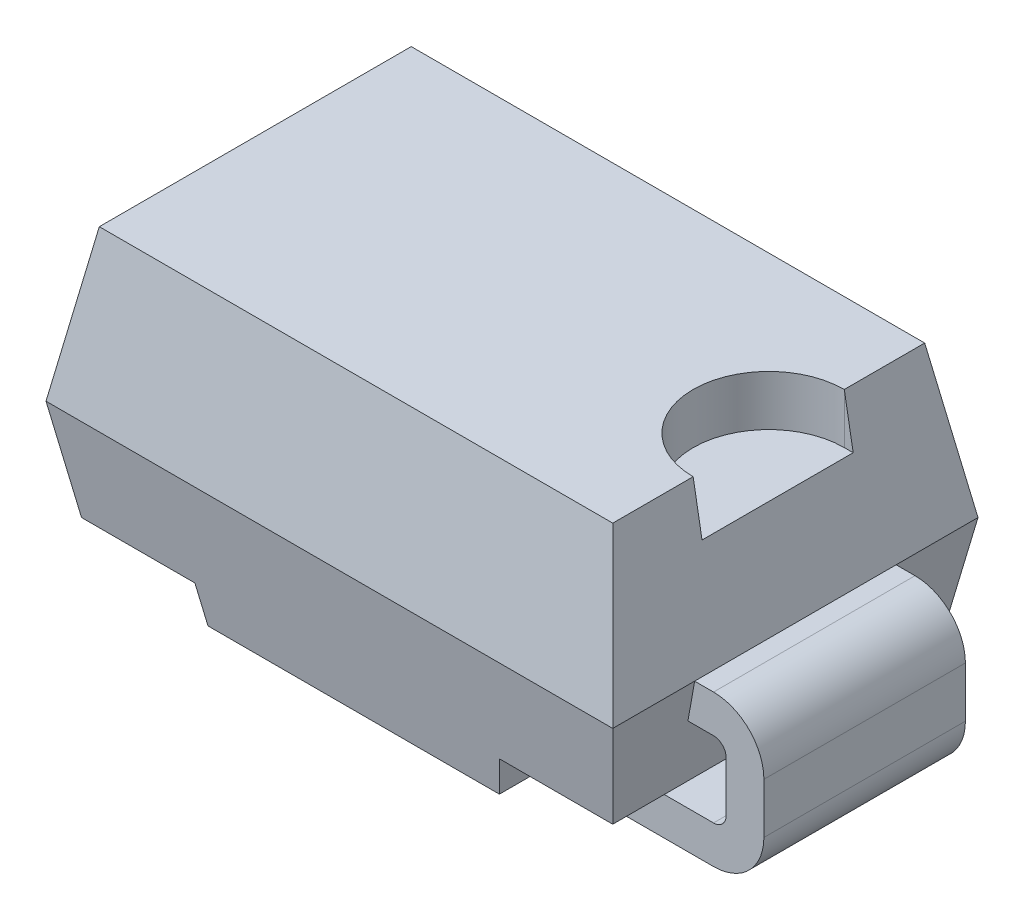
ISO-10303-21;
HEADER;
FILE_DESCRIPTION(('STEP AP214'),'2;1');
FILE_NAME('part.step','',(''),(''),'','','');
FILE_SCHEMA(('AUTOMOTIVE_DESIGN { 1 0 10303 214 1 1 1 1 }'));
ENDSEC;
DATA;
#1=APPLICATION_CONTEXT('core data for automotive mechanical design processes');
#2=APPLICATION_PROTOCOL_DEFINITION('international standard','automotive_design',2000,#1);
#3=PRODUCT_CONTEXT('',#1,'mechanical');
#4=PRODUCT('Part','Part','',(#3));
#5=PRODUCT_RELATED_PRODUCT_CATEGORY('part','',(#4));
#6=PRODUCT_DEFINITION_FORMATION('','',#4);
#7=PRODUCT_DEFINITION_CONTEXT('part definition',#1,'design');
#8=PRODUCT_DEFINITION('design','',#6,#7);
#9=PRODUCT_DEFINITION_SHAPE('','',#8);
#10=(LENGTH_UNIT() NAMED_UNIT(*) SI_UNIT(.MILLI.,.METRE.));
#11=(NAMED_UNIT(*) PLANE_ANGLE_UNIT() SI_UNIT($,.RADIAN.));
#12=(NAMED_UNIT(*) SI_UNIT($,.STERADIAN.) SOLID_ANGLE_UNIT());
#13=UNCERTAINTY_MEASURE_WITH_UNIT(LENGTH_MEASURE(1.E-05),#10,'distance_accuracy_value','');
#14=(GEOMETRIC_REPRESENTATION_CONTEXT(3) GLOBAL_UNCERTAINTY_ASSIGNED_CONTEXT((#13)) GLOBAL_UNIT_ASSIGNED_CONTEXT((#10,
#11,#12)) REPRESENTATION_CONTEXT('',''));
#15=CARTESIAN_POINT('',(0.,0.,0.));
#16=DIRECTION('',(0.,0.,1.));
#17=DIRECTION('',(1.,0.,0.));
#18=AXIS2_PLACEMENT_3D('',#15,#16,#17);
#19=CARTESIAN_POINT('',(-2.25,1.2,1.45));
#20=DIRECTION('',(0.984807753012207,0.173648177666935,0.));
#21=DIRECTION('',(-0.173648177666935,0.984807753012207,0.));
#22=AXIS2_PLACEMENT_3D('',#19,#20,#21);
#23=PLANE('',#22);
#24=DIRECTION('',(-0.17108786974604,0.970287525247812,-0.171087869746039));
#25=VECTOR('',#24,1.);
#26=CARTESIAN_POINT('',(-2.16511392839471,0.718587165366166,-1.36511392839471));
#27=LINE('',#26,#25);
#28=CARTESIAN_POINT('',(-2.10893841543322,0.4,-1.30893841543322));
#29=VERTEX_POINT('',#28);
#30=CARTESIAN_POINT('',(-2.25,1.2,-1.45));
#31=VERTEX_POINT('',#30);
#32=EDGE_CURVE('E322',#29,#31,#27,.T.);
#33=ORIENTED_EDGE('',*,*,#32,.F.);
#34=DIRECTION('',(0.,0.,-1.));
#35=VECTOR('',#34,1.);
#36=CARTESIAN_POINT('',(-2.10893841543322,0.4,1.45));
#37=LINE('',#36,#35);
#38=CARTESIAN_POINT('',(-2.10893841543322,0.4,1.30893841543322));
#39=VERTEX_POINT('',#38);
#40=EDGE_CURVE('E368',#39,#29,#37,.T.);
#41=ORIENTED_EDGE('',*,*,#40,.F.);
#42=DIRECTION('',(0.17108786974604,-0.970287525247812,-0.17108786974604));
#43=VECTOR('',#42,1.);
#44=CARTESIAN_POINT('',(-2.25,1.2,1.45));
#45=LINE('',#44,#43);
#46=CARTESIAN_POINT('',(-2.25,1.2,1.45));
#47=VERTEX_POINT('',#46);
#48=EDGE_CURVE('E339',#47,#39,#45,.T.);
#49=ORIENTED_EDGE('',*,*,#48,.F.);
#50=DIRECTION('',(0.,0.,-1.));
#51=VECTOR('',#50,1.);
#52=CARTESIAN_POINT('',(-2.25,1.2,1.45));
#53=LINE('',#52,#51);
#54=CARTESIAN_POINT('',(-2.25,1.2,0.8));
#55=VERTEX_POINT('',#54);
#56=EDGE_CURVE('E372',#47,#55,#53,.T.);
#57=ORIENTED_EDGE('',*,*,#56,.T.);
#58=DIRECTION('',(0.173648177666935,-0.984807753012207,0.));
#59=VECTOR('',#58,1.);
#60=CARTESIAN_POINT('',(-2.11771499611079,0.449774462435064,0.8));
#61=LINE('',#60,#59);
#62=CARTESIAN_POINT('',(-2.19710190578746,0.9,0.8));
#63=VERTEX_POINT('',#62);
#64=EDGE_CURVE('E382',#55,#63,#61,.T.);
#65=ORIENTED_EDGE('',*,*,#64,.T.);
#66=DIRECTION('',(0.,0.,-1.));
#67=VECTOR('',#66,1.);
#68=CARTESIAN_POINT('',(-2.19710190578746,0.9,0.8));
#69=LINE('',#68,#67);
#70=CARTESIAN_POINT('',(-2.19710190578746,0.9,-0.8));
#71=VERTEX_POINT('',#70);
#72=EDGE_CURVE('E380',#63,#71,#69,.T.);
#73=ORIENTED_EDGE('',*,*,#72,.T.);
#74=DIRECTION('',(0.173648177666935,-0.984807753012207,0.));
#75=VECTOR('',#74,1.);
#76=CARTESIAN_POINT('',(-2.11771499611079,0.449774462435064,-0.8));
#77=LINE('',#76,#75);
#78=CARTESIAN_POINT('',(-2.25,1.2,-0.8));
#79=VERTEX_POINT('',#78);
#80=EDGE_CURVE('E537',#79,#71,#77,.T.);
#81=ORIENTED_EDGE('',*,*,#80,.F.);
#82=EDGE_CURVE('E371',#79,#31,#53,.T.);
#83=ORIENTED_EDGE('',*,*,#82,.T.);
#84=EDGE_LOOP('',(#33,#41,#49,#57,#65,#73,#81,#83));
#85=FACE_BOUND('',#84,.T.);
#86=ADVANCED_FACE('F32',(#85),#23,.F.);
#87=CARTESIAN_POINT('',(2.25,1.2,1.45));
#88=DIRECTION('',(-0.984807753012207,0.173648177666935,0.));
#89=DIRECTION('',(-0.173648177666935,-0.984807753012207,0.));
#90=AXIS2_PLACEMENT_3D('',#87,#88,#89);
#91=PLANE('',#90);
#92=DIRECTION('',(-0.17108786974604,-0.970287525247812,0.171087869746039));
#93=VECTOR('',#92,1.);
#94=CARTESIAN_POINT('',(2.16511392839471,0.718587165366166,-1.36511392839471));
#95=LINE('',#94,#93);
#96=CARTESIAN_POINT('',(2.25,1.2,-1.45));
#97=VERTEX_POINT('',#96);
#98=CARTESIAN_POINT('',(2.10893841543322,0.4,-1.30893841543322));
#99=VERTEX_POINT('',#98);
#100=EDGE_CURVE('E320',#97,#99,#95,.T.);
#101=ORIENTED_EDGE('',*,*,#100,.F.);
#102=DIRECTION('',(0.,0.,-1.));
#103=VECTOR('',#102,1.);
#104=CARTESIAN_POINT('',(2.25,1.2,1.45));
#105=LINE('',#104,#103);
#106=CARTESIAN_POINT('',(2.25,1.2,-0.8));
#107=VERTEX_POINT('',#106);
#108=EDGE_CURVE('E348',#107,#97,#105,.T.);
#109=ORIENTED_EDGE('',*,*,#108,.F.);
#110=DIRECTION('',(0.173648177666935,0.984807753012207,0.));
#111=VECTOR('',#110,1.);
#112=CARTESIAN_POINT('',(1.97297728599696,-0.371073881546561,-0.8));
#113=LINE('',#112,#111);
#114=CARTESIAN_POINT('',(2.19710190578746,0.9,-0.8));
#115=VERTEX_POINT('',#114);
#116=EDGE_CURVE('E534',#115,#107,#113,.T.);
#117=ORIENTED_EDGE('',*,*,#116,.F.);
#118=DIRECTION('',(0.,0.,1.));
#119=VECTOR('',#118,1.);
#120=CARTESIAN_POINT('',(2.19710190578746,0.9,0.8));
#121=LINE('',#120,#119);
#122=CARTESIAN_POINT('',(2.19710190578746,0.9,0.8));
#123=VERTEX_POINT('',#122);
#124=EDGE_CURVE('E375',#115,#123,#121,.T.);
#125=ORIENTED_EDGE('',*,*,#124,.T.);
#126=DIRECTION('',(0.173648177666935,0.984807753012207,0.));
#127=VECTOR('',#126,1.);
#128=CARTESIAN_POINT('',(1.97297728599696,-0.371073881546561,0.8));
#129=LINE('',#128,#127);
#130=CARTESIAN_POINT('',(2.25,1.2,0.8));
#131=VERTEX_POINT('',#130);
#132=EDGE_CURVE('E378',#123,#131,#129,.T.);
#133=ORIENTED_EDGE('',*,*,#132,.T.);
#134=CARTESIAN_POINT('',(2.25,1.2,1.45));
#135=VERTEX_POINT('',#134);
#136=EDGE_CURVE('E349',#135,#131,#105,.T.);
#137=ORIENTED_EDGE('',*,*,#136,.F.);
#138=DIRECTION('',(0.17108786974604,0.970287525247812,0.17108786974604));
#139=VECTOR('',#138,1.);
#140=CARTESIAN_POINT('',(2.25,1.2,1.45));
#141=LINE('',#140,#139);
#142=CARTESIAN_POINT('',(2.10893841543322,0.4,1.30893841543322));
#143=VERTEX_POINT('',#142);
#144=EDGE_CURVE('E337',#143,#135,#141,.T.);
#145=ORIENTED_EDGE('',*,*,#144,.F.);
#146=DIRECTION('',(0.,0.,-1.));
#147=VECTOR('',#146,1.);
#148=CARTESIAN_POINT('',(2.10893841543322,0.4,1.45));
#149=LINE('',#148,#147);
#150=EDGE_CURVE('E352',#143,#99,#149,.T.);
#151=ORIENTED_EDGE('',*,*,#150,.T.);
#152=EDGE_LOOP('',(#101,#109,#117,#125,#133,#137,#145,#151));
#153=FACE_BOUND('',#152,.T.);
#154=ADVANCED_FACE('F631',(#153),#91,.F.);
#155=CARTESIAN_POINT('',(-2.03840762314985,2.4,1.45));
#156=DIRECTION('',(0.984807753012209,-0.173648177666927,0.));
#157=DIRECTION('',(0.173648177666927,0.984807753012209,0.));
#158=AXIS2_PLACEMENT_3D('',#155,#156,#157);
#159=PLANE('',#158);
#160=DIRECTION('',(-0.171087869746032,-0.970287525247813,0.17108786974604));
#161=VECTOR('',#160,1.);
#162=CARTESIAN_POINT('',(-2.04460115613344,2.36487472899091,1.24460115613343));
#163=LINE('',#162,#161);
#164=CARTESIAN_POINT('',(-2.03840762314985,2.4,1.23840762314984));
#165=VERTEX_POINT('',#164);
#166=EDGE_CURVE('E325',#165,#47,#163,.T.);
#167=ORIENTED_EDGE('',*,*,#166,.F.);
#168=DIRECTION('',(0.,0.,-1.));
#169=VECTOR('',#168,1.);
#170=CARTESIAN_POINT('',(-2.03840762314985,2.4,1.45));
#171=LINE('',#170,#169);
#172=CARTESIAN_POINT('',(-2.03840762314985,2.4,-1.23840762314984));
#173=VERTEX_POINT('',#172);
#174=EDGE_CURVE('E341',#165,#173,#171,.T.);
#175=ORIENTED_EDGE('',*,*,#174,.T.);
#176=DIRECTION('',(0.171087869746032,0.970287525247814,0.17108786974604));
#177=VECTOR('',#176,1.);
#178=CARTESIAN_POINT('',(-1.95971508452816,2.84628756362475,-1.15971508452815));
#179=LINE('',#178,#177);
#180=EDGE_CURVE('E308',#31,#173,#179,.T.);
#181=ORIENTED_EDGE('',*,*,#180,.F.);
#182=ORIENTED_EDGE('',*,*,#82,.F.);
#183=EDGE_CURVE('E376',#55,#79,#53,.T.);
#184=ORIENTED_EDGE('',*,*,#183,.F.);
#185=ORIENTED_EDGE('',*,*,#56,.F.);
#186=EDGE_LOOP('',(#167,#175,#181,#182,#184,#185));
#187=FACE_BOUND('',#186,.T.);
#188=ADVANCED_FACE('F557',(#187),#159,.F.);
#189=CARTESIAN_POINT('',(-2.10893841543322,0.4,1.45));
#190=DIRECTION('',(0.,1.,0.));
#191=DIRECTION('',(0.,0.,1.));
#192=AXIS2_PLACEMENT_3D('',#189,#190,#191);
#193=PLANE('',#192);
#194=DIRECTION('',(-1.,0.,0.));
#195=VECTOR('',#194,1.);
#196=CARTESIAN_POINT('',(-2.10893841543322,0.4,-1.30893841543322));
#197=LINE('',#196,#195);
#198=CARTESIAN_POINT('',(-1.20893841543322,0.4,-1.30893841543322));
#199=VERTEX_POINT('',#198);
#200=EDGE_CURVE('E318',#199,#29,#197,.T.);
#201=ORIENTED_EDGE('',*,*,#200,.F.);
#202=DIRECTION('',(0.,0.,-1.));
#203=VECTOR('',#202,1.);
#204=CARTESIAN_POINT('',(-1.20893841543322,0.4,1.45));
#205=LINE('',#204,#203);
#206=CARTESIAN_POINT('',(-1.20893841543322,0.4,1.30893841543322));
#207=VERTEX_POINT('',#206);
#208=EDGE_CURVE('E365',#207,#199,#205,.T.);
#209=ORIENTED_EDGE('',*,*,#208,.F.);
#210=DIRECTION('',(1.,0.,0.));
#211=VECTOR('',#210,1.);
#212=CARTESIAN_POINT('',(-2.10893841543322,0.4,1.30893841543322));
#213=LINE('',#212,#211);
#214=EDGE_CURVE('E335',#39,#207,#213,.T.);
#215=ORIENTED_EDGE('',*,*,#214,.F.);
#216=ORIENTED_EDGE('',*,*,#40,.T.);
#217=EDGE_LOOP('',(#201,#209,#215,#216));
#218=FACE_BOUND('',#217,.T.);
#219=ADVANCED_FACE('F640',(#218),#193,.F.);
#220=CARTESIAN_POINT('',(-1.20893841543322,0.4,1.45));
#221=DIRECTION('',(0.984807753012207,0.173648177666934,0.));
#222=DIRECTION('',(-0.173648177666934,0.984807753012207,0.));
#223=AXIS2_PLACEMENT_3D('',#220,#221,#222);
#224=PLANE('',#223);
#225=DIRECTION('',(-0.171087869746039,0.970287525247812,-0.171087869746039));
#226=VECTOR('',#225,1.);
#227=CARTESIAN_POINT('',(-1.128181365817,-0.0579959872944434,-1.228181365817));
#228=LINE('',#227,#226);
#229=CARTESIAN_POINT('',(-1.15684396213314,0.104557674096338,-1.25684396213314));
#230=VERTEX_POINT('',#229);
#231=EDGE_CURVE('E316',#230,#199,#228,.T.);
#232=ORIENTED_EDGE('',*,*,#231,.F.);
#233=DIRECTION('',(0.,0.,-1.));
#234=VECTOR('',#233,1.);
#235=CARTESIAN_POINT('',(-1.15684396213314,0.104557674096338,1.45));
#236=LINE('',#235,#234);
#237=CARTESIAN_POINT('',(-1.15684396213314,0.104557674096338,1.25684396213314));
#238=VERTEX_POINT('',#237);
#239=EDGE_CURVE('E362',#238,#230,#236,.T.);
#240=ORIENTED_EDGE('',*,*,#239,.F.);
#241=DIRECTION('',(0.171087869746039,-0.970287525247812,-0.17108786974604));
#242=VECTOR('',#241,1.);
#243=CARTESIAN_POINT('',(-1.21306743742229,0.42341684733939,1.31306743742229));
#244=LINE('',#243,#242);
#245=EDGE_CURVE('E333',#207,#238,#244,.T.);
#246=ORIENTED_EDGE('',*,*,#245,.F.);
#247=ORIENTED_EDGE('',*,*,#208,.T.);
#248=EDGE_LOOP('',(#232,#240,#246,#247));
#249=FACE_BOUND('',#248,.T.);
#250=ADVANCED_FACE('F708',(#249),#224,.F.);
#251=CARTESIAN_POINT('',(-1.15684396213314,0.104557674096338,1.45));
#252=DIRECTION('',(0.,1.,0.));
#253=DIRECTION('',(0.,0.,1.));
#254=AXIS2_PLACEMENT_3D('',#251,#252,#253);
#255=PLANE('',#254);
#256=DIRECTION('',(-1.,0.,0.));
#257=VECTOR('',#256,1.);
#258=CARTESIAN_POINT('',(-1.15684396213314,0.104557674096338,-1.25684396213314));
#259=LINE('',#258,#257);
#260=CARTESIAN_POINT('',(1.15684396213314,0.104557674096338,-1.25684396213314));
#261=VERTEX_POINT('',#260);
#262=EDGE_CURVE('E314',#261,#230,#259,.T.);
#263=ORIENTED_EDGE('',*,*,#262,.F.);
#264=DIRECTION('',(0.,0.,-1.));
#265=VECTOR('',#264,1.);
#266=CARTESIAN_POINT('',(1.15684396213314,0.104557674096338,1.45));
#267=LINE('',#266,#265);
#268=CARTESIAN_POINT('',(1.15684396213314,0.104557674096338,1.25684396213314));
#269=VERTEX_POINT('',#268);
#270=EDGE_CURVE('E359',#269,#261,#267,.T.);
#271=ORIENTED_EDGE('',*,*,#270,.F.);
#272=DIRECTION('',(1.,0.,0.));
#273=VECTOR('',#272,1.);
#274=CARTESIAN_POINT('',(-1.15684396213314,0.104557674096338,1.25684396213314));
#275=LINE('',#274,#273);
#276=EDGE_CURVE('E331',#238,#269,#275,.T.);
#277=ORIENTED_EDGE('',*,*,#276,.F.);
#278=ORIENTED_EDGE('',*,*,#239,.T.);
#279=EDGE_LOOP('',(#263,#271,#277,#278));
#280=FACE_BOUND('',#279,.T.);
#281=ADVANCED_FACE('F703',(#280),#255,.F.);
#282=CARTESIAN_POINT('',(1.20893841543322,0.4,1.45));
#283=DIRECTION('',(-0.984807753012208,0.173648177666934,0.));
#284=DIRECTION('',(-0.173648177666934,-0.984807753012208,0.));
#285=AXIS2_PLACEMENT_3D('',#282,#283,#284);
#286=PLANE('',#285);
#287=DIRECTION('',(-0.171087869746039,-0.970287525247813,0.171087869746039));
#288=VECTOR('',#287,1.);
#289=CARTESIAN_POINT('',(1.128181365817,-0.0579959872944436,-1.228181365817));
#290=LINE('',#289,#288);
#291=CARTESIAN_POINT('',(1.20893841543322,0.4,-1.30893841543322));
#292=VERTEX_POINT('',#291);
#293=EDGE_CURVE('E312',#292,#261,#290,.T.);
#294=ORIENTED_EDGE('',*,*,#293,.F.);
#295=DIRECTION('',(0.,0.,-1.));
#296=VECTOR('',#295,1.);
#297=CARTESIAN_POINT('',(1.20893841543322,0.4,1.45));
#298=LINE('',#297,#296);
#299=CARTESIAN_POINT('',(1.20893841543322,0.4,1.30893841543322));
#300=VERTEX_POINT('',#299);
#301=EDGE_CURVE('E356',#300,#292,#298,.T.);
#302=ORIENTED_EDGE('',*,*,#301,.F.);
#303=DIRECTION('',(0.171087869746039,0.970287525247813,0.17108786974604));
#304=VECTOR('',#303,1.);
#305=CARTESIAN_POINT('',(1.21306743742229,0.42341684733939,1.31306743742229));
#306=LINE('',#305,#304);
#307=EDGE_CURVE('E329',#269,#300,#306,.T.);
#308=ORIENTED_EDGE('',*,*,#307,.F.);
#309=ORIENTED_EDGE('',*,*,#270,.T.);
#310=EDGE_LOOP('',(#294,#302,#308,#309));
#311=FACE_BOUND('',#310,.T.);
#312=ADVANCED_FACE('F698',(#311),#286,.F.);
#313=CARTESIAN_POINT('',(2.10893841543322,0.4,1.45));
#314=DIRECTION('',(0.,1.,0.));
#315=DIRECTION('',(0.,0.,1.));
#316=AXIS2_PLACEMENT_3D('',#313,#314,#315);
#317=PLANE('',#316);
#318=DIRECTION('',(-1.,0.,0.));
#319=VECTOR('',#318,1.);
#320=CARTESIAN_POINT('',(2.10893841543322,0.4,-1.30893841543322));
#321=LINE('',#320,#319);
#322=EDGE_CURVE('E310',#99,#292,#321,.T.);
#323=ORIENTED_EDGE('',*,*,#322,.F.);
#324=ORIENTED_EDGE('',*,*,#150,.F.);
#325=DIRECTION('',(1.,0.,0.));
#326=VECTOR('',#325,1.);
#327=CARTESIAN_POINT('',(2.10893841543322,0.4,1.30893841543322));
#328=LINE('',#327,#326);
#329=EDGE_CURVE('E327',#300,#143,#328,.T.);
#330=ORIENTED_EDGE('',*,*,#329,.F.);
#331=ORIENTED_EDGE('',*,*,#301,.T.);
#332=EDGE_LOOP('',(#323,#324,#330,#331));
#333=FACE_BOUND('',#332,.T.);
#334=ADVANCED_FACE('F693',(#333),#317,.F.);
#335=CARTESIAN_POINT('',(2.03840762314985,2.4,1.45));
#336=DIRECTION('',(-0.984807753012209,-0.173648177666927,0.));
#337=DIRECTION('',(0.173648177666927,-0.984807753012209,0.));
#338=AXIS2_PLACEMENT_3D('',#335,#336,#337);
#339=PLANE('',#338);
#340=DIRECTION('',(0.,0.,1.));
#341=VECTOR('',#340,1.);
#342=CARTESIAN_POINT('',(2.10893841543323,2.,1.45));
#343=LINE('',#342,#341);
#344=CARTESIAN_POINT('',(2.10893841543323,2.,-0.6));
#345=VERTEX_POINT('',#344);
#346=CARTESIAN_POINT('',(2.10893841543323,2.,0.6));
#347=VERTEX_POINT('',#346);
#348=EDGE_CURVE('E280',#345,#347,#343,.T.);
#349=ORIENTED_EDGE('',*,*,#348,.T.);
#350=DIRECTION('',(-0.173648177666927,0.984807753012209,0.));
#351=VECTOR('',#350,1.);
#352=CARTESIAN_POINT('',(2.03840762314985,2.4,0.6));
#353=LINE('',#352,#351);
#354=CARTESIAN_POINT('',(2.03840762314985,2.4,0.6));
#355=VERTEX_POINT('',#354);
#356=EDGE_CURVE('E12',#347,#355,#353,.T.);
#357=ORIENTED_EDGE('',*,*,#356,.T.);
#358=DIRECTION('',(0.,0.,-1.));
#359=VECTOR('',#358,1.);
#360=CARTESIAN_POINT('',(2.03840762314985,2.4,1.45));
#361=LINE('',#360,#359);
#362=CARTESIAN_POINT('',(2.03840762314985,2.4,1.23840762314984));
#363=VERTEX_POINT('',#362);
#364=EDGE_CURVE('E345',#363,#355,#361,.T.);
#365=ORIENTED_EDGE('',*,*,#364,.F.);
#366=DIRECTION('',(-0.171087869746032,0.970287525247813,-0.17108786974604));
#367=VECTOR('',#366,1.);
#368=CARTESIAN_POINT('',(2.04460115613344,2.36487472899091,1.24460115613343));
#369=LINE('',#368,#367);
#370=EDGE_CURVE('E55',#135,#363,#369,.T.);
#371=ORIENTED_EDGE('',*,*,#370,.F.);
#372=ORIENTED_EDGE('',*,*,#136,.T.);
#373=EDGE_CURVE('E353',#131,#107,#105,.T.);
#374=ORIENTED_EDGE('',*,*,#373,.T.);
#375=ORIENTED_EDGE('',*,*,#108,.T.);
#376=DIRECTION('',(0.171087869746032,-0.970287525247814,-0.17108786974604));
#377=VECTOR('',#376,1.);
#378=CARTESIAN_POINT('',(1.95971508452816,2.84628756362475,-1.15971508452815));
#379=LINE('',#378,#377);
#380=CARTESIAN_POINT('',(2.03840762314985,2.4,-1.23840762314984));
#381=VERTEX_POINT('',#380);
#382=EDGE_CURVE('E299',#381,#97,#379,.T.);
#383=ORIENTED_EDGE('',*,*,#382,.F.);
#384=CARTESIAN_POINT('',(2.03840762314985,2.4,-0.6));
#385=VERTEX_POINT('',#384);
#386=EDGE_CURVE('E344',#385,#381,#361,.T.);
#387=ORIENTED_EDGE('',*,*,#386,.F.);
#388=DIRECTION('',(0.173648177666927,-0.984807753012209,0.));
#389=VECTOR('',#388,1.);
#390=CARTESIAN_POINT('',(2.03840762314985,2.4,-0.6));
#391=LINE('',#390,#389);
#392=EDGE_CURVE('E40',#385,#345,#391,.T.);
#393=ORIENTED_EDGE('',*,*,#392,.T.);
#394=EDGE_LOOP('',(#349,#357,#365,#371,#372,#374,#375,#383,#387,#393));
#395=FACE_BOUND('',#394,.T.);
#396=ADVANCED_FACE('F542',(#395),#339,.F.);
#397=CARTESIAN_POINT('',(2.03840762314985,2.4,1.45));
#398=DIRECTION('',(0.,-1.,0.));
#399=DIRECTION('',(0.,0.,-1.));
#400=AXIS2_PLACEMENT_3D('',#397,#398,#399);
#401=PLANE('',#400);
#402=ORIENTED_EDGE('',*,*,#364,.T.);
#403=CARTESIAN_POINT('',(2.03840762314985,2.4,0.));
#404=DIRECTION('',(0.,1.,0.));
#405=DIRECTION('',(1.,0.,0.));
#406=AXIS2_PLACEMENT_3D('',#403,#404,#405);
#407=CIRCLE('',#406,0.6);
#408=EDGE_CURVE('E283',#385,#355,#407,.T.);
#409=ORIENTED_EDGE('',*,*,#408,.F.);
#410=ORIENTED_EDGE('',*,*,#386,.T.);
#411=DIRECTION('',(1.,0.,0.));
#412=VECTOR('',#411,1.);
#413=CARTESIAN_POINT('',(-2.8,2.4,-1.23840762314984));
#414=LINE('',#413,#412);
#415=EDGE_CURVE('E302',#173,#381,#414,.T.);
#416=ORIENTED_EDGE('',*,*,#415,.F.);
#417=ORIENTED_EDGE('',*,*,#174,.F.);
#418=DIRECTION('',(1.,0.,0.));
#419=VECTOR('',#418,1.);
#420=CARTESIAN_POINT('',(-2.8,2.4,1.23840762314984));
#421=LINE('',#420,#419);
#422=EDGE_CURVE('E300',#165,#363,#421,.T.);
#423=ORIENTED_EDGE('',*,*,#422,.T.);
#424=EDGE_LOOP('',(#402,#409,#410,#416,#417,#423));
#425=FACE_BOUND('',#424,.T.);
#426=ADVANCED_FACE('F547',(#425),#401,.F.);
#427=CARTESIAN_POINT('',(-2.4,0.9,0.8));
#428=DIRECTION('',(0.,1.,0.));
#429=DIRECTION('',(0.,0.,1.));
#430=AXIS2_PLACEMENT_3D('',#427,#428,#429);
#431=PLANE('',#430);
#432=ORIENTED_EDGE('',*,*,#72,.F.);
#433=DIRECTION('',(1.,0.,0.));
#434=VECTOR('',#433,1.);
#435=CARTESIAN_POINT('',(-2.4,0.9,0.8));
#436=LINE('',#435,#434);
#437=CARTESIAN_POINT('',(-2.4,0.9,0.8));
#438=VERTEX_POINT('',#437);
#439=EDGE_CURVE('E398',#438,#63,#436,.T.);
#440=ORIENTED_EDGE('',*,*,#439,.F.);
#441=DIRECTION('',(0.,0.,-1.));
#442=VECTOR('',#441,1.);
#443=CARTESIAN_POINT('',(-2.4,0.9,0.8));
#444=LINE('',#443,#442);
#445=CARTESIAN_POINT('',(-2.4,0.9,-0.8));
#446=VERTEX_POINT('',#445);
#447=EDGE_CURVE('E519',#438,#446,#444,.T.);
#448=ORIENTED_EDGE('',*,*,#447,.T.);
#449=DIRECTION('',(1.,0.,0.));
#450=VECTOR('',#449,1.);
#451=CARTESIAN_POINT('',(-2.4,0.9,-0.8));
#452=LINE('',#451,#450);
#453=EDGE_CURVE('E443',#446,#71,#452,.T.);
#454=ORIENTED_EDGE('',*,*,#453,.T.);
#455=EDGE_LOOP('',(#432,#440,#448,#454));
#456=FACE_BOUND('',#455,.T.);
#457=ADVANCED_FACE('F591',(#456),#431,.F.);
#458=CARTESIAN_POINT('',(-2.4,1.2,0.8));
#459=DIRECTION('',(0.,-1.,0.));
#460=DIRECTION('',(0.,0.,-1.));
#461=AXIS2_PLACEMENT_3D('',#458,#459,#460);
#462=PLANE('',#461);
#463=ORIENTED_EDGE('',*,*,#183,.T.);
#464=DIRECTION('',(-1.,0.,0.));
#465=VECTOR('',#464,1.);
#466=CARTESIAN_POINT('',(-2.4,1.2,-0.8));
#467=LINE('',#466,#465);
#468=CARTESIAN_POINT('',(-2.4,1.2,-0.8));
#469=VERTEX_POINT('',#468);
#470=EDGE_CURVE('E464',#79,#469,#467,.T.);
#471=ORIENTED_EDGE('',*,*,#470,.T.);
#472=DIRECTION('',(0.,0.,-1.));
#473=VECTOR('',#472,1.);
#474=CARTESIAN_POINT('',(-2.4,1.2,0.8));
#475=LINE('',#474,#473);
#476=CARTESIAN_POINT('',(-2.4,1.2,0.8));
#477=VERTEX_POINT('',#476);
#478=EDGE_CURVE('E486',#477,#469,#475,.T.);
#479=ORIENTED_EDGE('',*,*,#478,.F.);
#480=DIRECTION('',(-1.,0.,0.));
#481=VECTOR('',#480,1.);
#482=CARTESIAN_POINT('',(-2.4,1.2,0.8));
#483=LINE('',#482,#481);
#484=EDGE_CURVE('E419',#55,#477,#483,.T.);
#485=ORIENTED_EDGE('',*,*,#484,.F.);
#486=EDGE_LOOP('',(#463,#471,#479,#485));
#487=FACE_BOUND('',#486,.T.);
#488=ADVANCED_FACE('F565',(#487),#462,.F.);
#489=CARTESIAN_POINT('',(-2.4,0.4,0.8));
#490=DIRECTION('',(0.,0.,-1.));
#491=DIRECTION('',(-1.,0.,0.));
#492=AXIS2_PLACEMENT_3D('',#489,#490,#491);
#493=PLANE('',#492);
#494=ORIENTED_EDGE('',*,*,#64,.F.);
#495=ORIENTED_EDGE('',*,*,#484,.T.);
#496=CARTESIAN_POINT('',(-2.4,0.8,0.8));
#497=DIRECTION('',(0.,0.,1.));
#498=DIRECTION('',(-1.,0.,0.));
#499=AXIS2_PLACEMENT_3D('',#496,#497,#498);
#500=CIRCLE('',#499,0.4);
#501=CARTESIAN_POINT('',(-2.8,0.8,0.8));
#502=VERTEX_POINT('',#501);
#503=EDGE_CURVE('E423',#477,#502,#500,.T.);
#504=ORIENTED_EDGE('',*,*,#503,.T.);
#505=DIRECTION('',(0.,-1.,0.));
#506=VECTOR('',#505,1.);
#507=CARTESIAN_POINT('',(-2.8,0.4,0.8));
#508=LINE('',#507,#506);
#509=CARTESIAN_POINT('',(-2.8,0.4,0.8));
#510=VERTEX_POINT('',#509);
#511=EDGE_CURVE('E425',#502,#510,#508,.T.);
#512=ORIENTED_EDGE('',*,*,#511,.T.);
#513=CARTESIAN_POINT('',(-2.4,0.4,0.8));
#514=DIRECTION('',(0.,0.,1.));
#515=DIRECTION('',(-1.,0.,0.));
#516=AXIS2_PLACEMENT_3D('',#513,#514,#515);
#517=CIRCLE('',#516,0.4);
#518=CARTESIAN_POINT('',(-2.4,0.,0.8));
#519=VERTEX_POINT('',#518);
#520=EDGE_CURVE('E427',#510,#519,#517,.T.);
#521=ORIENTED_EDGE('',*,*,#520,.T.);
#522=DIRECTION('',(1.,0.,0.));
#523=VECTOR('',#522,1.);
#524=CARTESIAN_POINT('',(-1.5,0.,0.8));
#525=LINE('',#524,#523);
#526=CARTESIAN_POINT('',(-1.5,0.,0.8));
#527=VERTEX_POINT('',#526);
#528=EDGE_CURVE('E429',#519,#527,#525,.T.);
#529=ORIENTED_EDGE('',*,*,#528,.T.);
#530=DIRECTION('',(0.,1.,0.));
#531=VECTOR('',#530,1.);
#532=CARTESIAN_POINT('',(-1.5,0.,0.8));
#533=LINE('',#532,#531);
#534=CARTESIAN_POINT('',(-1.5,0.3,0.8));
#535=VERTEX_POINT('',#534);
#536=EDGE_CURVE('E385',#527,#535,#533,.T.);
#537=ORIENTED_EDGE('',*,*,#536,.T.);
#538=DIRECTION('',(-1.,0.,0.));
#539=VECTOR('',#538,1.);
#540=CARTESIAN_POINT('',(-1.5,0.3,0.8));
#541=LINE('',#540,#539);
#542=CARTESIAN_POINT('',(-2.4,0.3,0.8));
#543=VERTEX_POINT('',#542);
#544=EDGE_CURVE('E388',#535,#543,#541,.T.);
#545=ORIENTED_EDGE('',*,*,#544,.T.);
#546=CARTESIAN_POINT('',(-2.4,0.4,0.8));
#547=DIRECTION('',(0.,0.,-1.));
#548=DIRECTION('',(-1.,0.,0.));
#549=AXIS2_PLACEMENT_3D('',#546,#547,#548);
#550=CIRCLE('',#549,0.1);
#551=CARTESIAN_POINT('',(-2.5,0.4,0.8));
#552=VERTEX_POINT('',#551);
#553=EDGE_CURVE('E391',#543,#552,#550,.T.);
#554=ORIENTED_EDGE('',*,*,#553,.T.);
#555=DIRECTION('',(0.,1.,0.));
#556=VECTOR('',#555,1.);
#557=CARTESIAN_POINT('',(-2.5,0.4,0.8));
#558=LINE('',#557,#556);
#559=CARTESIAN_POINT('',(-2.5,0.8,0.8));
#560=VERTEX_POINT('',#559);
#561=EDGE_CURVE('E393',#552,#560,#558,.T.);
#562=ORIENTED_EDGE('',*,*,#561,.T.);
#563=CARTESIAN_POINT('',(-2.4,0.8,0.8));
#564=DIRECTION('',(0.,0.,-1.));
#565=DIRECTION('',(-1.,0.,0.));
#566=AXIS2_PLACEMENT_3D('',#563,#564,#565);
#567=CIRCLE('',#566,0.1);
#568=EDGE_CURVE('E395',#560,#438,#567,.T.);
#569=ORIENTED_EDGE('',*,*,#568,.T.);
#570=ORIENTED_EDGE('',*,*,#439,.T.);
#571=EDGE_LOOP('',(#494,#495,#504,#512,#521,#529,#537,#545,#554,#562,#569,#570));
#572=FACE_BOUND('',#571,.T.);
#573=ADVANCED_FACE('F585',(#572),#493,.F.);
#574=CARTESIAN_POINT('',(-2.4,0.4,-0.8));
#575=DIRECTION('',(0.,0.,-1.));
#576=DIRECTION('',(-1.,0.,0.));
#577=AXIS2_PLACEMENT_3D('',#574,#575,#576);
#578=PLANE('',#577);
#579=ORIENTED_EDGE('',*,*,#470,.F.);
#580=ORIENTED_EDGE('',*,*,#80,.T.);
#581=ORIENTED_EDGE('',*,*,#453,.F.);
#582=CARTESIAN_POINT('',(-2.4,0.8,-0.8));
#583=DIRECTION('',(0.,0.,-1.));
#584=DIRECTION('',(-1.,0.,0.));
#585=AXIS2_PLACEMENT_3D('',#582,#583,#584);
#586=CIRCLE('',#585,0.1);
#587=CARTESIAN_POINT('',(-2.5,0.8,-0.8));
#588=VERTEX_POINT('',#587);
#589=EDGE_CURVE('E440',#588,#446,#586,.T.);
#590=ORIENTED_EDGE('',*,*,#589,.F.);
#591=DIRECTION('',(0.,1.,0.));
#592=VECTOR('',#591,1.);
#593=CARTESIAN_POINT('',(-2.5,0.4,-0.8));
#594=LINE('',#593,#592);
#595=CARTESIAN_POINT('',(-2.5,0.4,-0.8));
#596=VERTEX_POINT('',#595);
#597=EDGE_CURVE('E438',#596,#588,#594,.T.);
#598=ORIENTED_EDGE('',*,*,#597,.F.);
#599=CARTESIAN_POINT('',(-2.4,0.4,-0.8));
#600=DIRECTION('',(0.,0.,-1.));
#601=DIRECTION('',(-1.,0.,0.));
#602=AXIS2_PLACEMENT_3D('',#599,#600,#601);
#603=CIRCLE('',#602,0.1);
#604=CARTESIAN_POINT('',(-2.4,0.3,-0.8));
#605=VERTEX_POINT('',#604);
#606=EDGE_CURVE('E436',#605,#596,#603,.T.);
#607=ORIENTED_EDGE('',*,*,#606,.F.);
#608=DIRECTION('',(-1.,0.,0.));
#609=VECTOR('',#608,1.);
#610=CARTESIAN_POINT('',(-1.5,0.3,-0.8));
#611=LINE('',#610,#609);
#612=CARTESIAN_POINT('',(-1.5,0.3,-0.8));
#613=VERTEX_POINT('',#612);
#614=EDGE_CURVE('E434',#613,#605,#611,.T.);
#615=ORIENTED_EDGE('',*,*,#614,.F.);
#616=DIRECTION('',(0.,1.,0.));
#617=VECTOR('',#616,1.);
#618=CARTESIAN_POINT('',(-1.5,0.,-0.8));
#619=LINE('',#618,#617);
#620=CARTESIAN_POINT('',(-1.5,0.,-0.8));
#621=VERTEX_POINT('',#620);
#622=EDGE_CURVE('E384',#621,#613,#619,.T.);
#623=ORIENTED_EDGE('',*,*,#622,.F.);
#624=DIRECTION('',(1.,0.,0.));
#625=VECTOR('',#624,1.);
#626=CARTESIAN_POINT('',(-1.5,0.,-0.8));
#627=LINE('',#626,#625);
#628=CARTESIAN_POINT('',(-2.4,0.,-0.8));
#629=VERTEX_POINT('',#628);
#630=EDGE_CURVE('E389',#629,#621,#627,.T.);
#631=ORIENTED_EDGE('',*,*,#630,.F.);
#632=CARTESIAN_POINT('',(-2.4,0.4,-0.8));
#633=DIRECTION('',(0.,0.,1.));
#634=DIRECTION('',(-1.,0.,0.));
#635=AXIS2_PLACEMENT_3D('',#632,#633,#634);
#636=CIRCLE('',#635,0.4);
#637=CARTESIAN_POINT('',(-2.8,0.4,-0.8));
#638=VERTEX_POINT('',#637);
#639=EDGE_CURVE('E472',#638,#629,#636,.T.);
#640=ORIENTED_EDGE('',*,*,#639,.F.);
#641=DIRECTION('',(0.,-1.,0.));
#642=VECTOR('',#641,1.);
#643=CARTESIAN_POINT('',(-2.8,0.4,-0.8));
#644=LINE('',#643,#642);
#645=CARTESIAN_POINT('',(-2.8,0.8,-0.8));
#646=VERTEX_POINT('',#645);
#647=EDGE_CURVE('E470',#646,#638,#644,.T.);
#648=ORIENTED_EDGE('',*,*,#647,.F.);
#649=CARTESIAN_POINT('',(-2.4,0.8,-0.8));
#650=DIRECTION('',(0.,0.,1.));
#651=DIRECTION('',(-1.,0.,0.));
#652=AXIS2_PLACEMENT_3D('',#649,#650,#651);
#653=CIRCLE('',#652,0.4);
#654=EDGE_CURVE('E468',#469,#646,#653,.T.);
#655=ORIENTED_EDGE('',*,*,#654,.F.);
#656=EDGE_LOOP('',(#579,#580,#581,#590,#598,#607,#615,#623,#631,#640,#648,#655));
#657=FACE_BOUND('',#656,.T.);
#658=ADVANCED_FACE('F570',(#657),#578,.T.);
#659=CARTESIAN_POINT('',(-1.5,0.,0.8));
#660=DIRECTION('',(-1.,0.,0.));
#661=DIRECTION('',(0.,0.,1.));
#662=AXIS2_PLACEMENT_3D('',#659,#660,#661);
#663=PLANE('',#662);
#664=ORIENTED_EDGE('',*,*,#622,.T.);
#665=DIRECTION('',(0.,0.,-1.));
#666=VECTOR('',#665,1.);
#667=CARTESIAN_POINT('',(-1.5,0.3,0.8));
#668=LINE('',#667,#666);
#669=EDGE_CURVE('E531',#535,#613,#668,.T.);
#670=ORIENTED_EDGE('',*,*,#669,.F.);
#671=ORIENTED_EDGE('',*,*,#536,.F.);
#672=DIRECTION('',(0.,0.,-1.));
#673=VECTOR('',#672,1.);
#674=CARTESIAN_POINT('',(-1.5,0.,0.8));
#675=LINE('',#674,#673);
#676=EDGE_CURVE('E431',#527,#621,#675,.T.);
#677=ORIENTED_EDGE('',*,*,#676,.T.);
#678=EDGE_LOOP('',(#664,#670,#671,#677));
#679=FACE_BOUND('',#678,.T.);
#680=ADVANCED_FACE('F34',(#679),#663,.F.);
#681=CARTESIAN_POINT('',(-1.5,0.3,0.8));
#682=DIRECTION('',(0.,-1.,0.));
#683=DIRECTION('',(1.,0.,0.));
#684=AXIS2_PLACEMENT_3D('',#681,#682,#683);
#685=PLANE('',#684);
#686=ORIENTED_EDGE('',*,*,#614,.T.);
#687=DIRECTION('',(0.,0.,-1.));
#688=VECTOR('',#687,1.);
#689=CARTESIAN_POINT('',(-2.4,0.3,0.8));
#690=LINE('',#689,#688);
#691=EDGE_CURVE('E528',#543,#605,#690,.T.);
#692=ORIENTED_EDGE('',*,*,#691,.F.);
#693=ORIENTED_EDGE('',*,*,#544,.F.);
#694=ORIENTED_EDGE('',*,*,#669,.T.);
#695=EDGE_LOOP('',(#686,#692,#693,#694));
#696=FACE_BOUND('',#695,.T.);
#697=ADVANCED_FACE('F612',(#696),#685,.F.);
#698=CARTESIAN_POINT('',(-2.4,0.4,0.8));
#699=DIRECTION('',(0.,0.,-1.));
#700=DIRECTION('',(-1.,0.,0.));
#701=AXIS2_PLACEMENT_3D('',#698,#699,#700);
#702=CYLINDRICAL_SURFACE('',#701,0.1);
#703=ORIENTED_EDGE('',*,*,#606,.T.);
#704=DIRECTION('',(0.,0.,-1.));
#705=VECTOR('',#704,1.);
#706=CARTESIAN_POINT('',(-2.5,0.4,0.8));
#707=LINE('',#706,#705);
#708=EDGE_CURVE('E525',#552,#596,#707,.T.);
#709=ORIENTED_EDGE('',*,*,#708,.F.);
#710=ORIENTED_EDGE('',*,*,#553,.F.);
#711=ORIENTED_EDGE('',*,*,#691,.T.);
#712=EDGE_LOOP('',(#703,#709,#710,#711));
#713=FACE_BOUND('',#712,.T.);
#714=ADVANCED_FACE('F606',(#713),#702,.F.);
#715=CARTESIAN_POINT('',(-2.5,0.4,0.8));
#716=DIRECTION('',(-1.,0.,0.));
#717=DIRECTION('',(0.,0.,1.));
#718=AXIS2_PLACEMENT_3D('',#715,#716,#717);
#719=PLANE('',#718);
#720=ORIENTED_EDGE('',*,*,#597,.T.);
#721=DIRECTION('',(0.,0.,-1.));
#722=VECTOR('',#721,1.);
#723=CARTESIAN_POINT('',(-2.5,0.8,0.8));
#724=LINE('',#723,#722);
#725=EDGE_CURVE('E522',#560,#588,#724,.T.);
#726=ORIENTED_EDGE('',*,*,#725,.F.);
#727=ORIENTED_EDGE('',*,*,#561,.F.);
#728=ORIENTED_EDGE('',*,*,#708,.T.);
#729=EDGE_LOOP('',(#720,#726,#727,#728));
#730=FACE_BOUND('',#729,.T.);
#731=ADVANCED_FACE('F602',(#730),#719,.F.);
#732=CARTESIAN_POINT('',(-2.4,0.8,0.8));
#733=DIRECTION('',(0.,0.,-1.));
#734=DIRECTION('',(-1.,0.,0.));
#735=AXIS2_PLACEMENT_3D('',#732,#733,#734);
#736=CYLINDRICAL_SURFACE('',#735,0.1);
#737=ORIENTED_EDGE('',*,*,#589,.T.);
#738=ORIENTED_EDGE('',*,*,#447,.F.);
#739=ORIENTED_EDGE('',*,*,#568,.F.);
#740=ORIENTED_EDGE('',*,*,#725,.T.);
#741=EDGE_LOOP('',(#737,#738,#739,#740));
#742=FACE_BOUND('',#741,.T.);
#743=ADVANCED_FACE('F597',(#742),#736,.F.);
#744=CARTESIAN_POINT('',(-2.4,0.8,0.8));
#745=DIRECTION('',(0.,0.,-1.));
#746=DIRECTION('',(-1.,0.,0.));
#747=AXIS2_PLACEMENT_3D('',#744,#745,#746);
#748=CYLINDRICAL_SURFACE('',#747,0.4);
#749=ORIENTED_EDGE('',*,*,#654,.T.);
#750=DIRECTION('',(0.,0.,-1.));
#751=VECTOR('',#750,1.);
#752=CARTESIAN_POINT('',(-2.8,0.8,0.8));
#753=LINE('',#752,#751);
#754=EDGE_CURVE('E483',#502,#646,#753,.T.);
#755=ORIENTED_EDGE('',*,*,#754,.F.);
#756=ORIENTED_EDGE('',*,*,#503,.F.);
#757=ORIENTED_EDGE('',*,*,#478,.T.);
#758=EDGE_LOOP('',(#749,#755,#756,#757));
#759=FACE_BOUND('',#758,.T.);
#760=ADVANCED_FACE('F576',(#759),#748,.T.);
#761=CARTESIAN_POINT('',(-2.8,0.4,0.8));
#762=DIRECTION('',(1.,0.,0.));
#763=DIRECTION('',(0.,1.,0.));
#764=AXIS2_PLACEMENT_3D('',#761,#762,#763);
#765=PLANE('',#764);
#766=ORIENTED_EDGE('',*,*,#647,.T.);
#767=DIRECTION('',(0.,0.,-1.));
#768=VECTOR('',#767,1.);
#769=CARTESIAN_POINT('',(-2.8,0.4,0.8));
#770=LINE('',#769,#768);
#771=EDGE_CURVE('E480',#510,#638,#770,.T.);
#772=ORIENTED_EDGE('',*,*,#771,.F.);
#773=ORIENTED_EDGE('',*,*,#511,.F.);
#774=ORIENTED_EDGE('',*,*,#754,.T.);
#775=EDGE_LOOP('',(#766,#772,#773,#774));
#776=FACE_BOUND('',#775,.T.);
#777=ADVANCED_FACE('F580',(#776),#765,.F.);
#778=CARTESIAN_POINT('',(-2.4,0.4,0.8));
#779=DIRECTION('',(0.,0.,-1.));
#780=DIRECTION('',(-1.,0.,0.));
#781=AXIS2_PLACEMENT_3D('',#778,#779,#780);
#782=CYLINDRICAL_SURFACE('',#781,0.4);
#783=ORIENTED_EDGE('',*,*,#639,.T.);
#784=DIRECTION('',(0.,0.,-1.));
#785=VECTOR('',#784,1.);
#786=CARTESIAN_POINT('',(-2.4,0.,0.8));
#787=LINE('',#786,#785);
#788=EDGE_CURVE('E477',#519,#629,#787,.T.);
#789=ORIENTED_EDGE('',*,*,#788,.F.);
#790=ORIENTED_EDGE('',*,*,#520,.F.);
#791=ORIENTED_EDGE('',*,*,#771,.T.);
#792=EDGE_LOOP('',(#783,#789,#790,#791));
#793=FACE_BOUND('',#792,.T.);
#794=ADVANCED_FACE('F620',(#793),#782,.T.);
#795=CARTESIAN_POINT('',(-1.5,0.,0.8));
#796=DIRECTION('',(0.,1.,0.));
#797=DIRECTION('',(-1.,0.,0.));
#798=AXIS2_PLACEMENT_3D('',#795,#796,#797);
#799=PLANE('',#798);
#800=ORIENTED_EDGE('',*,*,#630,.T.);
#801=ORIENTED_EDGE('',*,*,#676,.F.);
#802=ORIENTED_EDGE('',*,*,#528,.F.);
#803=ORIENTED_EDGE('',*,*,#788,.T.);
#804=EDGE_LOOP('',(#800,#801,#802,#803));
#805=FACE_BOUND('',#804,.T.);
#806=ADVANCED_FACE('F618',(#805),#799,.F.);
#807=CARTESIAN_POINT('',(2.4,0.8,0.8));
#808=DIRECTION('',(0.,0.,-1.));
#809=DIRECTION('',(-1.,0.,0.));
#810=AXIS2_PLACEMENT_3D('',#807,#808,#809);
#811=CYLINDRICAL_SURFACE('',#810,0.1);
#812=CARTESIAN_POINT('',(2.4,0.8,-0.8));
#813=DIRECTION('',(0.,0.,-1.));
#814=DIRECTION('',(1.,0.,0.));
#815=AXIS2_PLACEMENT_3D('',#812,#813,#814);
#816=CIRCLE('',#815,0.1);
#817=CARTESIAN_POINT('',(2.4,0.9,-0.8));
#818=VERTEX_POINT('',#817);
#819=CARTESIAN_POINT('',(2.5,0.8,-0.8));
#820=VERTEX_POINT('',#819);
#821=EDGE_CURVE('E446',#818,#820,#816,.T.);
#822=ORIENTED_EDGE('',*,*,#821,.T.);
#823=DIRECTION('',(0.,0.,-1.));
#824=VECTOR('',#823,1.);
#825=CARTESIAN_POINT('',(2.5,0.8,0.8));
#826=LINE('',#825,#824);
#827=CARTESIAN_POINT('',(2.5,0.8,0.8));
#828=VERTEX_POINT('',#827);
#829=EDGE_CURVE('E513',#828,#820,#826,.T.);
#830=ORIENTED_EDGE('',*,*,#829,.F.);
#831=CARTESIAN_POINT('',(2.4,0.8,0.8));
#832=DIRECTION('',(0.,0.,-1.));
#833=DIRECTION('',(1.,0.,0.));
#834=AXIS2_PLACEMENT_3D('',#831,#832,#833);
#835=CIRCLE('',#834,0.1);
#836=CARTESIAN_POINT('',(2.4,0.9,0.8));
#837=VERTEX_POINT('',#836);
#838=EDGE_CURVE('E401',#837,#828,#835,.T.);
#839=ORIENTED_EDGE('',*,*,#838,.F.);
#840=DIRECTION('',(0.,0.,-1.));
#841=VECTOR('',#840,1.);
#842=CARTESIAN_POINT('',(2.4,0.9,0.8));
#843=LINE('',#842,#841);
#844=EDGE_CURVE('E516',#837,#818,#843,.T.);
#845=ORIENTED_EDGE('',*,*,#844,.T.);
#846=EDGE_LOOP('',(#822,#830,#839,#845));
#847=FACE_BOUND('',#846,.T.);
#848=ADVANCED_FACE('F627',(#847),#811,.F.);
#849=CARTESIAN_POINT('',(2.5,0.4,0.8));
#850=DIRECTION('',(1.,0.,0.));
#851=DIRECTION('',(0.,0.,-1.));
#852=AXIS2_PLACEMENT_3D('',#849,#850,#851);
#853=PLANE('',#852);
#854=DIRECTION('',(0.,-1.,0.));
#855=VECTOR('',#854,1.);
#856=CARTESIAN_POINT('',(2.5,0.4,-0.8));
#857=LINE('',#856,#855);
#858=CARTESIAN_POINT('',(2.5,0.4,-0.8));
#859=VERTEX_POINT('',#858);
#860=EDGE_CURVE('E448',#820,#859,#857,.T.);
#861=ORIENTED_EDGE('',*,*,#860,.T.);
#862=DIRECTION('',(0.,0.,-1.));
#863=VECTOR('',#862,1.);
#864=CARTESIAN_POINT('',(2.5,0.4,0.8));
#865=LINE('',#864,#863);
#866=CARTESIAN_POINT('',(2.5,0.4,0.8));
#867=VERTEX_POINT('',#866);
#868=EDGE_CURVE('E510',#867,#859,#865,.T.);
#869=ORIENTED_EDGE('',*,*,#868,.F.);
#870=DIRECTION('',(0.,-1.,0.));
#871=VECTOR('',#870,1.);
#872=CARTESIAN_POINT('',(2.5,0.4,0.8));
#873=LINE('',#872,#871);
#874=EDGE_CURVE('E403',#828,#867,#873,.T.);
#875=ORIENTED_EDGE('',*,*,#874,.F.);
#876=ORIENTED_EDGE('',*,*,#829,.T.);
#877=EDGE_LOOP('',(#861,#869,#875,#876));
#878=FACE_BOUND('',#877,.T.);
#879=ADVANCED_FACE('F907',(#878),#853,.F.);
#880=CARTESIAN_POINT('',(2.4,0.4,0.8));
#881=DIRECTION('',(0.,0.,-1.));
#882=DIRECTION('',(-1.,0.,0.));
#883=AXIS2_PLACEMENT_3D('',#880,#881,#882);
#884=CYLINDRICAL_SURFACE('',#883,0.1);
#885=CARTESIAN_POINT('',(2.4,0.4,-0.8));
#886=DIRECTION('',(0.,0.,-1.));
#887=DIRECTION('',(1.,0.,0.));
#888=AXIS2_PLACEMENT_3D('',#885,#886,#887);
#889=CIRCLE('',#888,0.1);
#890=CARTESIAN_POINT('',(2.4,0.3,-0.8));
#891=VERTEX_POINT('',#890);
#892=EDGE_CURVE('E450',#859,#891,#889,.T.);
#893=ORIENTED_EDGE('',*,*,#892,.T.);
#894=DIRECTION('',(0.,0.,-1.));
#895=VECTOR('',#894,1.);
#896=CARTESIAN_POINT('',(2.4,0.3,0.8));
#897=LINE('',#896,#895);
#898=CARTESIAN_POINT('',(2.4,0.3,0.8));
#899=VERTEX_POINT('',#898);
#900=EDGE_CURVE('E507',#899,#891,#897,.T.);
#901=ORIENTED_EDGE('',*,*,#900,.F.);
#902=CARTESIAN_POINT('',(2.4,0.4,0.8));
#903=DIRECTION('',(0.,0.,-1.));
#904=DIRECTION('',(1.,0.,0.));
#905=AXIS2_PLACEMENT_3D('',#902,#903,#904);
#906=CIRCLE('',#905,0.1);
#907=EDGE_CURVE('E405',#867,#899,#906,.T.);
#908=ORIENTED_EDGE('',*,*,#907,.F.);
#909=ORIENTED_EDGE('',*,*,#868,.T.);
#910=EDGE_LOOP('',(#893,#901,#908,#909));
#911=FACE_BOUND('',#910,.T.);
#912=ADVANCED_FACE('F897',(#911),#884,.F.);
#913=CARTESIAN_POINT('',(1.5,0.3,0.8));
#914=DIRECTION('',(0.,-1.,0.));
#915=DIRECTION('',(1.,0.,0.));
#916=AXIS2_PLACEMENT_3D('',#913,#914,#915);
#917=PLANE('',#916);
#918=DIRECTION('',(-1.,0.,0.));
#919=VECTOR('',#918,1.);
#920=CARTESIAN_POINT('',(1.5,0.3,-0.8));
#921=LINE('',#920,#919);
#922=CARTESIAN_POINT('',(1.5,0.3,-0.8));
#923=VERTEX_POINT('',#922);
#924=EDGE_CURVE('E452',#891,#923,#921,.T.);
#925=ORIENTED_EDGE('',*,*,#924,.T.);
#926=DIRECTION('',(0.,0.,-1.));
#927=VECTOR('',#926,1.);
#928=CARTESIAN_POINT('',(1.5,0.3,0.8));
#929=LINE('',#928,#927);
#930=CARTESIAN_POINT('',(1.5,0.3,0.8));
#931=VERTEX_POINT('',#930);
#932=EDGE_CURVE('E504',#931,#923,#929,.T.);
#933=ORIENTED_EDGE('',*,*,#932,.F.);
#934=DIRECTION('',(-1.,0.,0.));
#935=VECTOR('',#934,1.);
#936=CARTESIAN_POINT('',(1.5,0.3,0.8));
#937=LINE('',#936,#935);
#938=EDGE_CURVE('E407',#899,#931,#937,.T.);
#939=ORIENTED_EDGE('',*,*,#938,.F.);
#940=ORIENTED_EDGE('',*,*,#900,.T.);
#941=EDGE_LOOP('',(#925,#933,#939,#940));
#942=FACE_BOUND('',#941,.T.);
#943=ADVANCED_FACE('F887',(#942),#917,.F.);
#944=CARTESIAN_POINT('',(1.5,0.,0.8));
#945=DIRECTION('',(1.,0.,0.));
#946=DIRECTION('',(0.,0.,-1.));
#947=AXIS2_PLACEMENT_3D('',#944,#945,#946);
#948=PLANE('',#947);
#949=DIRECTION('',(0.,-1.,0.));
#950=VECTOR('',#949,1.);
#951=CARTESIAN_POINT('',(1.5,0.,-0.8));
#952=LINE('',#951,#950);
#953=CARTESIAN_POINT('',(1.5,0.,-0.8));
#954=VERTEX_POINT('',#953);
#955=EDGE_CURVE('E454',#923,#954,#952,.T.);
#956=ORIENTED_EDGE('',*,*,#955,.T.);
#957=DIRECTION('',(0.,0.,-1.));
#958=VECTOR('',#957,1.);
#959=CARTESIAN_POINT('',(1.5,0.,0.8));
#960=LINE('',#959,#958);
#961=CARTESIAN_POINT('',(1.5,0.,0.8));
#962=VERTEX_POINT('',#961);
#963=EDGE_CURVE('E501',#962,#954,#960,.T.);
#964=ORIENTED_EDGE('',*,*,#963,.F.);
#965=DIRECTION('',(0.,-1.,0.));
#966=VECTOR('',#965,1.);
#967=CARTESIAN_POINT('',(1.5,0.,0.8));
#968=LINE('',#967,#966);
#969=EDGE_CURVE('E409',#931,#962,#968,.T.);
#970=ORIENTED_EDGE('',*,*,#969,.F.);
#971=ORIENTED_EDGE('',*,*,#932,.T.);
#972=EDGE_LOOP('',(#956,#964,#970,#971));
#973=FACE_BOUND('',#972,.T.);
#974=ADVANCED_FACE('F877',(#973),#948,.F.);
#975=CARTESIAN_POINT('',(1.5,0.,0.8));
#976=DIRECTION('',(0.,1.,0.));
#977=DIRECTION('',(-1.,0.,0.));
#978=AXIS2_PLACEMENT_3D('',#975,#976,#977);
#979=PLANE('',#978);
#980=DIRECTION('',(1.,0.,0.));
#981=VECTOR('',#980,1.);
#982=CARTESIAN_POINT('',(1.5,0.,-0.8));
#983=LINE('',#982,#981);
#984=CARTESIAN_POINT('',(2.4,0.,-0.8));
#985=VERTEX_POINT('',#984);
#986=EDGE_CURVE('E456',#954,#985,#983,.T.);
#987=ORIENTED_EDGE('',*,*,#986,.T.);
#988=DIRECTION('',(0.,0.,-1.));
#989=VECTOR('',#988,1.);
#990=CARTESIAN_POINT('',(2.4,0.,0.8));
#991=LINE('',#990,#989);
#992=CARTESIAN_POINT('',(2.4,0.,0.8));
#993=VERTEX_POINT('',#992);
#994=EDGE_CURVE('E498',#993,#985,#991,.T.);
#995=ORIENTED_EDGE('',*,*,#994,.F.);
#996=DIRECTION('',(1.,0.,0.));
#997=VECTOR('',#996,1.);
#998=CARTESIAN_POINT('',(1.5,0.,0.8));
#999=LINE('',#998,#997);
#1000=EDGE_CURVE('E411',#962,#993,#999,.T.);
#1001=ORIENTED_EDGE('',*,*,#1000,.F.);
#1002=ORIENTED_EDGE('',*,*,#963,.T.);
#1003=EDGE_LOOP('',(#987,#995,#1001,#1002));
#1004=FACE_BOUND('',#1003,.T.);
#1005=ADVANCED_FACE('F867',(#1004),#979,.F.);
#1006=CARTESIAN_POINT('',(2.4,0.4,0.8));
#1007=DIRECTION('',(0.,0.,-1.));
#1008=DIRECTION('',(-1.,0.,0.));
#1009=AXIS2_PLACEMENT_3D('',#1006,#1007,#1008);
#1010=CYLINDRICAL_SURFACE('',#1009,0.4);
#1011=CARTESIAN_POINT('',(2.4,0.4,-0.8));
#1012=DIRECTION('',(0.,0.,1.));
#1013=DIRECTION('',(1.,0.,0.));
#1014=AXIS2_PLACEMENT_3D('',#1011,#1012,#1013);
#1015=CIRCLE('',#1014,0.4);
#1016=CARTESIAN_POINT('',(2.8,0.4,-0.8));
#1017=VERTEX_POINT('',#1016);
#1018=EDGE_CURVE('E458',#985,#1017,#1015,.T.);
#1019=ORIENTED_EDGE('',*,*,#1018,.T.);
#1020=DIRECTION('',(0.,0.,-1.));
#1021=VECTOR('',#1020,1.);
#1022=CARTESIAN_POINT('',(2.8,0.4,0.8));
#1023=LINE('',#1022,#1021);
#1024=CARTESIAN_POINT('',(2.8,0.4,0.8));
#1025=VERTEX_POINT('',#1024);
#1026=EDGE_CURVE('E495',#1025,#1017,#1023,.T.);
#1027=ORIENTED_EDGE('',*,*,#1026,.F.);
#1028=CARTESIAN_POINT('',(2.4,0.4,0.8));
#1029=DIRECTION('',(0.,0.,1.));
#1030=DIRECTION('',(1.,0.,0.));
#1031=AXIS2_PLACEMENT_3D('',#1028,#1029,#1030);
#1032=CIRCLE('',#1031,0.4);
#1033=EDGE_CURVE('E413',#993,#1025,#1032,.T.);
#1034=ORIENTED_EDGE('',*,*,#1033,.F.);
#1035=ORIENTED_EDGE('',*,*,#994,.T.);
#1036=EDGE_LOOP('',(#1019,#1027,#1034,#1035));
#1037=FACE_BOUND('',#1036,.T.);
#1038=ADVANCED_FACE('F857',(#1037),#1010,.T.);
#1039=CARTESIAN_POINT('',(2.8,0.4,0.8));
#1040=DIRECTION('',(-1.,0.,0.));
#1041=DIRECTION('',(0.,0.,1.));
#1042=AXIS2_PLACEMENT_3D('',#1039,#1040,#1041);
#1043=PLANE('',#1042);
#1044=DIRECTION('',(0.,1.,0.));
#1045=VECTOR('',#1044,1.);
#1046=CARTESIAN_POINT('',(2.8,0.4,-0.8));
#1047=LINE('',#1046,#1045);
#1048=CARTESIAN_POINT('',(2.8,0.8,-0.8));
#1049=VERTEX_POINT('',#1048);
#1050=EDGE_CURVE('E460',#1017,#1049,#1047,.T.);
#1051=ORIENTED_EDGE('',*,*,#1050,.T.);
#1052=DIRECTION('',(0.,0.,-1.));
#1053=VECTOR('',#1052,1.);
#1054=CARTESIAN_POINT('',(2.8,0.8,0.8));
#1055=LINE('',#1054,#1053);
#1056=CARTESIAN_POINT('',(2.8,0.8,0.8));
#1057=VERTEX_POINT('',#1056);
#1058=EDGE_CURVE('E492',#1057,#1049,#1055,.T.);
#1059=ORIENTED_EDGE('',*,*,#1058,.F.);
#1060=DIRECTION('',(0.,1.,0.));
#1061=VECTOR('',#1060,1.);
#1062=CARTESIAN_POINT('',(2.8,0.4,0.8));
#1063=LINE('',#1062,#1061);
#1064=EDGE_CURVE('E415',#1025,#1057,#1063,.T.);
#1065=ORIENTED_EDGE('',*,*,#1064,.F.);
#1066=ORIENTED_EDGE('',*,*,#1026,.T.);
#1067=EDGE_LOOP('',(#1051,#1059,#1065,#1066));
#1068=FACE_BOUND('',#1067,.T.);
#1069=ADVANCED_FACE('F661',(#1068),#1043,.F.);
#1070=CARTESIAN_POINT('',(2.4,0.8,0.8));
#1071=DIRECTION('',(0.,0.,-1.));
#1072=DIRECTION('',(-1.,0.,0.));
#1073=AXIS2_PLACEMENT_3D('',#1070,#1071,#1072);
#1074=CYLINDRICAL_SURFACE('',#1073,0.4);
#1075=CARTESIAN_POINT('',(2.4,0.8,-0.8));
#1076=DIRECTION('',(0.,0.,1.));
#1077=DIRECTION('',(1.,0.,0.));
#1078=AXIS2_PLACEMENT_3D('',#1075,#1076,#1077);
#1079=CIRCLE('',#1078,0.4);
#1080=CARTESIAN_POINT('',(2.4,1.2,-0.8));
#1081=VERTEX_POINT('',#1080);
#1082=EDGE_CURVE('E462',#1049,#1081,#1079,.T.);
#1083=ORIENTED_EDGE('',*,*,#1082,.T.);
#1084=DIRECTION('',(0.,0.,-1.));
#1085=VECTOR('',#1084,1.);
#1086=CARTESIAN_POINT('',(2.4,1.2,0.8));
#1087=LINE('',#1086,#1085);
#1088=CARTESIAN_POINT('',(2.4,1.2,0.8));
#1089=VERTEX_POINT('',#1088);
#1090=EDGE_CURVE('E489',#1089,#1081,#1087,.T.);
#1091=ORIENTED_EDGE('',*,*,#1090,.F.);
#1092=CARTESIAN_POINT('',(2.4,0.8,0.8));
#1093=DIRECTION('',(0.,0.,1.));
#1094=DIRECTION('',(1.,0.,0.));
#1095=AXIS2_PLACEMENT_3D('',#1092,#1093,#1094);
#1096=CIRCLE('',#1095,0.4);
#1097=EDGE_CURVE('E417',#1057,#1089,#1096,.T.);
#1098=ORIENTED_EDGE('',*,*,#1097,.F.);
#1099=ORIENTED_EDGE('',*,*,#1058,.T.);
#1100=EDGE_LOOP('',(#1083,#1091,#1098,#1099));
#1101=FACE_BOUND('',#1100,.T.);
#1102=ADVANCED_FACE('F653',(#1101),#1074,.T.);
#1103=EDGE_CURVE('E442',#115,#818,#452,.T.);
#1104=ORIENTED_EDGE('',*,*,#1103,.F.);
#1105=ORIENTED_EDGE('',*,*,#116,.T.);
#1106=EDGE_CURVE('E465',#1081,#107,#467,.T.);
#1107=ORIENTED_EDGE('',*,*,#1106,.F.);
#1108=ORIENTED_EDGE('',*,*,#1082,.F.);
#1109=ORIENTED_EDGE('',*,*,#1050,.F.);
#1110=ORIENTED_EDGE('',*,*,#1018,.F.);
#1111=ORIENTED_EDGE('',*,*,#986,.F.);
#1112=ORIENTED_EDGE('',*,*,#955,.F.);
#1113=ORIENTED_EDGE('',*,*,#924,.F.);
#1114=ORIENTED_EDGE('',*,*,#892,.F.);
#1115=ORIENTED_EDGE('',*,*,#860,.F.);
#1116=ORIENTED_EDGE('',*,*,#821,.F.);
#1117=EDGE_LOOP('',(#1104,#1105,#1107,#1108,#1109,#1110,#1111,#1112,#1113,#1114,#1115,#1116));
#1118=FACE_BOUND('',#1117,.T.);
#1119=ADVANCED_FACE('F648',(#1118),#578,.T.);
#1120=ORIENTED_EDGE('',*,*,#132,.F.);
#1121=EDGE_CURVE('E397',#123,#837,#436,.T.);
#1122=ORIENTED_EDGE('',*,*,#1121,.T.);
#1123=ORIENTED_EDGE('',*,*,#838,.T.);
#1124=ORIENTED_EDGE('',*,*,#874,.T.);
#1125=ORIENTED_EDGE('',*,*,#907,.T.);
#1126=ORIENTED_EDGE('',*,*,#938,.T.);
#1127=ORIENTED_EDGE('',*,*,#969,.T.);
#1128=ORIENTED_EDGE('',*,*,#1000,.T.);
#1129=ORIENTED_EDGE('',*,*,#1033,.T.);
#1130=ORIENTED_EDGE('',*,*,#1064,.T.);
#1131=ORIENTED_EDGE('',*,*,#1097,.T.);
#1132=EDGE_CURVE('E420',#1089,#131,#483,.T.);
#1133=ORIENTED_EDGE('',*,*,#1132,.T.);
#1134=EDGE_LOOP('',(#1120,#1122,#1123,#1124,#1125,#1126,#1127,#1128,#1129,#1130,#1131,#1133));
#1135=FACE_BOUND('',#1134,.T.);
#1136=ADVANCED_FACE('F646',(#1135),#493,.F.);
#1137=ORIENTED_EDGE('',*,*,#373,.F.);
#1138=ORIENTED_EDGE('',*,*,#1132,.F.);
#1139=ORIENTED_EDGE('',*,*,#1090,.T.);
#1140=ORIENTED_EDGE('',*,*,#1106,.T.);
#1141=EDGE_LOOP('',(#1137,#1138,#1139,#1140));
#1142=FACE_BOUND('',#1141,.T.);
#1143=ADVANCED_FACE('F659',(#1142),#462,.F.);
#1144=ORIENTED_EDGE('',*,*,#124,.F.);
#1145=ORIENTED_EDGE('',*,*,#1103,.T.);
#1146=ORIENTED_EDGE('',*,*,#844,.F.);
#1147=ORIENTED_EDGE('',*,*,#1121,.F.);
#1148=EDGE_LOOP('',(#1144,#1145,#1146,#1147));
#1149=FACE_BOUND('',#1148,.T.);
#1150=ADVANCED_FACE('F671',(#1149),#431,.F.);
#1151=CARTESIAN_POINT('',(-2.8,1.2,-1.45));
#1152=DIRECTION('',(0.,0.173648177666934,-0.984807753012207));
#1153=DIRECTION('',(0.,0.984807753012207,0.173648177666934));
#1154=AXIS2_PLACEMENT_3D('',#1151,#1152,#1153);
#1155=PLANE('',#1154);
#1156=ORIENTED_EDGE('',*,*,#180,.T.);
#1157=ORIENTED_EDGE('',*,*,#415,.T.);
#1158=ORIENTED_EDGE('',*,*,#382,.T.);
#1159=DIRECTION('',(1.,0.,0.));
#1160=VECTOR('',#1159,1.);
#1161=CARTESIAN_POINT('',(-2.8,1.2,-1.45));
#1162=LINE('',#1161,#1160);
#1163=EDGE_CURVE('E295',#31,#97,#1162,.T.);
#1164=ORIENTED_EDGE('',*,*,#1163,.F.);
#1165=EDGE_LOOP('',(#1156,#1157,#1158,#1164));
#1166=FACE_BOUND('',#1165,.T.);
#1167=ADVANCED_FACE('F550',(#1166),#1155,.T.);
#1168=CARTESIAN_POINT('',(-2.8,1.2,-1.45));
#1169=DIRECTION('',(0.,-0.173648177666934,-0.984807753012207));
#1170=DIRECTION('',(0.,0.984807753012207,-0.173648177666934));
#1171=AXIS2_PLACEMENT_3D('',#1168,#1169,#1170);
#1172=PLANE('',#1171);
#1173=ORIENTED_EDGE('',*,*,#32,.T.);
#1174=ORIENTED_EDGE('',*,*,#1163,.T.);
#1175=ORIENTED_EDGE('',*,*,#100,.T.);
#1176=ORIENTED_EDGE('',*,*,#322,.T.);
#1177=ORIENTED_EDGE('',*,*,#293,.T.);
#1178=ORIENTED_EDGE('',*,*,#262,.T.);
#1179=ORIENTED_EDGE('',*,*,#231,.T.);
#1180=ORIENTED_EDGE('',*,*,#200,.T.);
#1181=EDGE_LOOP('',(#1173,#1174,#1175,#1176,#1177,#1178,#1179,#1180));
#1182=FACE_BOUND('',#1181,.T.);
#1183=ADVANCED_FACE('F690',(#1182),#1172,.T.);
#1184=CARTESIAN_POINT('',(-2.8,1.2,1.45));
#1185=DIRECTION('',(0.,-0.173648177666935,0.984807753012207));
#1186=DIRECTION('',(0.,-0.984807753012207,-0.173648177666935));
#1187=AXIS2_PLACEMENT_3D('',#1184,#1185,#1186);
#1188=PLANE('',#1187);
#1189=ORIENTED_EDGE('',*,*,#48,.T.);
#1190=ORIENTED_EDGE('',*,*,#214,.T.);
#1191=ORIENTED_EDGE('',*,*,#245,.T.);
#1192=ORIENTED_EDGE('',*,*,#276,.T.);
#1193=ORIENTED_EDGE('',*,*,#307,.T.);
#1194=ORIENTED_EDGE('',*,*,#329,.T.);
#1195=ORIENTED_EDGE('',*,*,#144,.T.);
#1196=DIRECTION('',(1.,0.,0.));
#1197=VECTOR('',#1196,1.);
#1198=CARTESIAN_POINT('',(-2.8,1.2,1.45));
#1199=LINE('',#1198,#1197);
#1200=EDGE_CURVE('E297',#47,#135,#1199,.T.);
#1201=ORIENTED_EDGE('',*,*,#1200,.F.);
#1202=EDGE_LOOP('',(#1189,#1190,#1191,#1192,#1193,#1194,#1195,#1201));
#1203=FACE_BOUND('',#1202,.T.);
#1204=ADVANCED_FACE('F725',(#1203),#1188,.T.);
#1205=CARTESIAN_POINT('',(-2.8,1.2,1.45));
#1206=DIRECTION('',(0.,0.173648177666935,0.984807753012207));
#1207=DIRECTION('',(0.,-0.984807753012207,0.173648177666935));
#1208=AXIS2_PLACEMENT_3D('',#1205,#1206,#1207);
#1209=PLANE('',#1208);
#1210=ORIENTED_EDGE('',*,*,#166,.T.);
#1211=ORIENTED_EDGE('',*,*,#1200,.T.);
#1212=ORIENTED_EDGE('',*,*,#370,.T.);
#1213=ORIENTED_EDGE('',*,*,#422,.F.);
#1214=EDGE_LOOP('',(#1210,#1211,#1212,#1213));
#1215=FACE_BOUND('',#1214,.T.);
#1216=ADVANCED_FACE('F718',(#1215),#1209,.T.);
#1217=CARTESIAN_POINT('',(2.03840762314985,2.,0.6));
#1218=DIRECTION('',(0.,0.,1.));
#1219=DIRECTION('',(1.,0.,0.));
#1220=AXIS2_PLACEMENT_3D('',#1217,#1218,#1219);
#1221=PLANE('',#1220);
#1222=DIRECTION('',(1.,0.,0.));
#1223=VECTOR('',#1222,1.);
#1224=CARTESIAN_POINT('',(2.03840762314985,2.,0.6));
#1225=LINE('',#1224,#1223);
#1226=CARTESIAN_POINT('',(2.03840762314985,2.,0.6));
#1227=VERTEX_POINT('',#1226);
#1228=EDGE_CURVE('E288',#1227,#347,#1225,.T.);
#1229=ORIENTED_EDGE('',*,*,#1228,.F.);
#1230=DIRECTION('',(0.,1.,0.));
#1231=VECTOR('',#1230,1.);
#1232=CARTESIAN_POINT('',(2.03840762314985,2.,0.6));
#1233=LINE('',#1232,#1231);
#1234=EDGE_CURVE('E287',#1227,#355,#1233,.T.);
#1235=ORIENTED_EDGE('',*,*,#1234,.T.);
#1236=ORIENTED_EDGE('',*,*,#356,.F.);
#1237=EDGE_LOOP('',(#1229,#1235,#1236));
#1238=FACE_BOUND('',#1237,.T.);
#1239=ADVANCED_FACE('F716',(#1238),#1221,.F.);
#1240=CARTESIAN_POINT('',(2.25,2.,-0.6));
#1241=DIRECTION('',(0.,0.,-1.));
#1242=DIRECTION('',(-1.,0.,0.));
#1243=AXIS2_PLACEMENT_3D('',#1240,#1241,#1242);
#1244=PLANE('',#1243);
#1245=DIRECTION('',(0.,1.,0.));
#1246=VECTOR('',#1245,1.);
#1247=CARTESIAN_POINT('',(2.03840762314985,2.,-0.6));
#1248=LINE('',#1247,#1246);
#1249=CARTESIAN_POINT('',(2.03840762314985,2.,-0.6));
#1250=VERTEX_POINT('',#1249);
#1251=EDGE_CURVE('E47',#1250,#385,#1248,.T.);
#1252=ORIENTED_EDGE('',*,*,#1251,.F.);
#1253=DIRECTION('',(-1.,0.,0.));
#1254=VECTOR('',#1253,1.);
#1255=CARTESIAN_POINT('',(2.25,2.,-0.6));
#1256=LINE('',#1255,#1254);
#1257=EDGE_CURVE('E274',#345,#1250,#1256,.T.);
#1258=ORIENTED_EDGE('',*,*,#1257,.F.);
#1259=ORIENTED_EDGE('',*,*,#392,.F.);
#1260=EDGE_LOOP('',(#1252,#1258,#1259));
#1261=FACE_BOUND('',#1260,.T.);
#1262=ADVANCED_FACE('F285',(#1261),#1244,.F.);
#1263=CARTESIAN_POINT('',(2.03840762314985,2.,0.));
#1264=DIRECTION('',(0.,-1.,0.));
#1265=DIRECTION('',(1.,0.,0.));
#1266=AXIS2_PLACEMENT_3D('',#1263,#1264,#1265);
#1267=PLANE('',#1266);
#1268=ORIENTED_EDGE('',*,*,#1257,.T.);
#1269=CARTESIAN_POINT('',(2.03840762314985,2.,0.));
#1270=DIRECTION('',(0.,1.,0.));
#1271=DIRECTION('',(1.,0.,0.));
#1272=AXIS2_PLACEMENT_3D('',#1269,#1270,#1271);
#1273=CIRCLE('',#1272,0.6);
#1274=EDGE_CURVE('E277',#1250,#1227,#1273,.T.);
#1275=ORIENTED_EDGE('',*,*,#1274,.T.);
#1276=ORIENTED_EDGE('',*,*,#1228,.T.);
#1277=ORIENTED_EDGE('',*,*,#348,.F.);
#1278=EDGE_LOOP('',(#1268,#1275,#1276,#1277));
#1279=FACE_BOUND('',#1278,.T.);
#1280=ADVANCED_FACE('F275',(#1279),#1267,.F.);
#1281=CARTESIAN_POINT('',(2.03840762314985,2.,0.));
#1282=DIRECTION('',(0.,1.,0.));
#1283=DIRECTION('',(-1.,0.,0.));
#1284=AXIS2_PLACEMENT_3D('',#1281,#1282,#1283);
#1285=CYLINDRICAL_SURFACE('',#1284,0.6);
#1286=ORIENTED_EDGE('',*,*,#408,.T.);
#1287=ORIENTED_EDGE('',*,*,#1234,.F.);
#1288=ORIENTED_EDGE('',*,*,#1274,.F.);
#1289=ORIENTED_EDGE('',*,*,#1251,.T.);
#1290=EDGE_LOOP('',(#1286,#1287,#1288,#1289));
#1291=FACE_BOUND('',#1290,.T.);
#1292=ADVANCED_FACE('F290',(#1291),#1285,.F.);
#1293=CLOSED_SHELL('',(#86,#154,#188,#219,#250,#281,#312,#334,#396,#426,#457,#488,#573,#658,
#680,#697,#714,#731,#743,#760,#777,#794,#806,#848,#879,#912,#943,#974,#1005,#1038,#1069,#1102,
#1119,#1136,#1143,#1150,#1167,#1183,#1204,#1216,#1239,#1262,#1280,#1292));
#1294=MANIFOLD_SOLID_BREP('B2',#1293);
#1295=ADVANCED_BREP_SHAPE_REPRESENTATION('',(#18,#1294),#14);
#1296=SHAPE_DEFINITION_REPRESENTATION(#9,#1295);
ENDSEC;
END-ISO-10303-21;
